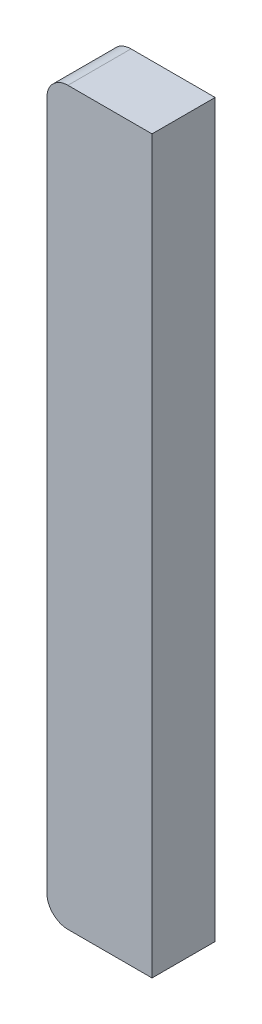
ISO-10303-21;
HEADER;
FILE_DESCRIPTION(('STEP AP214'),'2;1');
FILE_NAME('part.step','',(''),(''),'','','');
FILE_SCHEMA(('AUTOMOTIVE_DESIGN { 1 0 10303 214 1 1 1 1 }'));
ENDSEC;
DATA;
#1=APPLICATION_CONTEXT('core data for automotive mechanical design processes');
#2=APPLICATION_PROTOCOL_DEFINITION('international standard','automotive_design',2000,#1);
#3=PRODUCT_CONTEXT('',#1,'mechanical');
#4=PRODUCT('Part','Part','',(#3));
#5=PRODUCT_RELATED_PRODUCT_CATEGORY('part','',(#4));
#6=PRODUCT_DEFINITION_FORMATION('','',#4);
#7=PRODUCT_DEFINITION_CONTEXT('part definition',#1,'design');
#8=PRODUCT_DEFINITION('design','',#6,#7);
#9=PRODUCT_DEFINITION_SHAPE('','',#8);
#10=(LENGTH_UNIT() NAMED_UNIT(*) SI_UNIT(.MILLI.,.METRE.));
#11=(NAMED_UNIT(*) PLANE_ANGLE_UNIT() SI_UNIT($,.RADIAN.));
#12=(NAMED_UNIT(*) SI_UNIT($,.STERADIAN.) SOLID_ANGLE_UNIT());
#13=UNCERTAINTY_MEASURE_WITH_UNIT(LENGTH_MEASURE(1.E-05),#10,'distance_accuracy_value','');
#14=(GEOMETRIC_REPRESENTATION_CONTEXT(3) GLOBAL_UNCERTAINTY_ASSIGNED_CONTEXT((#13)) GLOBAL_UNIT_ASSIGNED_CONTEXT((#10,
#11,#12)) REPRESENTATION_CONTEXT('',''));
#15=CARTESIAN_POINT('',(0.,0.,0.));
#16=DIRECTION('',(0.,0.,1.));
#17=DIRECTION('',(1.,0.,0.));
#18=AXIS2_PLACEMENT_3D('',#15,#16,#17);
#19=CARTESIAN_POINT('',(-4.,-7.90989795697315,3.));
#20=DIRECTION('',(0.,-1.,0.));
#21=DIRECTION('',(0.,0.,-1.));
#22=AXIS2_PLACEMENT_3D('',#19,#20,#21);
#23=PLANE('',#22);
#24=DIRECTION('',(-1.,0.,0.));
#25=VECTOR('',#24,1.);
#26=CARTESIAN_POINT('',(-4.,-7.90989795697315,0.));
#27=LINE('',#26,#25);
#28=CARTESIAN_POINT('',(0.,-7.90989795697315,0.));
#29=VERTEX_POINT('',#28);
#30=CARTESIAN_POINT('',(-4.,-7.90989795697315,0.));
#31=VERTEX_POINT('',#30);
#32=EDGE_CURVE('E117',#29,#31,#27,.T.);
#33=ORIENTED_EDGE('',*,*,#32,.T.);
#34=DIRECTION('',(0.,0.,-1.));
#35=VECTOR('',#34,1.);
#36=CARTESIAN_POINT('',(-4.,-7.90989795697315,3.));
#37=LINE('',#36,#35);
#38=CARTESIAN_POINT('',(-4.,-7.90989795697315,3.));
#39=VERTEX_POINT('',#38);
#40=EDGE_CURVE('E11',#39,#31,#37,.T.);
#41=ORIENTED_EDGE('',*,*,#40,.F.);
#42=DIRECTION('',(-1.,0.,0.));
#43=VECTOR('',#42,1.);
#44=CARTESIAN_POINT('',(-4.,-7.90989795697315,3.));
#45=LINE('',#44,#43);
#46=CARTESIAN_POINT('',(0.,-7.90989795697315,3.));
#47=VERTEX_POINT('',#46);
#48=EDGE_CURVE('E127',#47,#39,#45,.T.);
#49=ORIENTED_EDGE('',*,*,#48,.F.);
#50=DIRECTION('',(0.,0.,-1.));
#51=VECTOR('',#50,1.);
#52=CARTESIAN_POINT('',(0.,-7.90989795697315,3.));
#53=LINE('',#52,#51);
#54=EDGE_CURVE('E113',#47,#29,#53,.T.);
#55=ORIENTED_EDGE('',*,*,#54,.T.);
#56=EDGE_LOOP('',(#33,#41,#49,#55));
#57=FACE_BOUND('',#56,.T.);
#58=ADVANCED_FACE('F33',(#57),#23,.F.);
#59=CARTESIAN_POINT('',(-4.,-8.90989795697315,3.));
#60=DIRECTION('',(0.,0.,-1.));
#61=DIRECTION('',(-1.,0.,0.));
#62=AXIS2_PLACEMENT_3D('',#59,#60,#61);
#63=CYLINDRICAL_SURFACE('',#62,1.);
#64=CARTESIAN_POINT('',(-4.,-8.90989795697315,0.));
#65=DIRECTION('',(0.,0.,1.));
#66=DIRECTION('',(-1.,0.,0.));
#67=AXIS2_PLACEMENT_3D('',#64,#65,#66);
#68=CIRCLE('',#67,1.);
#69=CARTESIAN_POINT('',(-5.,-8.90989795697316,0.));
#70=VERTEX_POINT('',#69);
#71=EDGE_CURVE('E120',#31,#70,#68,.T.);
#72=ORIENTED_EDGE('',*,*,#71,.T.);
#73=DIRECTION('',(0.,0.,-1.));
#74=VECTOR('',#73,1.);
#75=CARTESIAN_POINT('',(-5.,-8.90989795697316,3.));
#76=LINE('',#75,#74);
#77=CARTESIAN_POINT('',(-5.,-8.90989795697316,3.));
#78=VERTEX_POINT('',#77);
#79=EDGE_CURVE('E41',#78,#70,#76,.T.);
#80=ORIENTED_EDGE('',*,*,#79,.F.);
#81=CARTESIAN_POINT('',(-4.,-8.90989795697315,3.));
#82=DIRECTION('',(0.,0.,1.));
#83=DIRECTION('',(-1.,0.,0.));
#84=AXIS2_PLACEMENT_3D('',#81,#82,#83);
#85=CIRCLE('',#84,1.);
#86=EDGE_CURVE('E86',#39,#78,#85,.T.);
#87=ORIENTED_EDGE('',*,*,#86,.F.);
#88=ORIENTED_EDGE('',*,*,#40,.T.);
#89=EDGE_LOOP('',(#72,#80,#87,#88));
#90=FACE_BOUND('',#89,.T.);
#91=ADVANCED_FACE('F151',(#90),#63,.T.);
#92=CARTESIAN_POINT('',(-5.,-41.665103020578,3.));
#93=DIRECTION('',(1.,0.,0.));
#94=DIRECTION('',(0.,0.,-1.));
#95=AXIS2_PLACEMENT_3D('',#92,#93,#94);
#96=PLANE('',#95);
#97=DIRECTION('',(0.,-1.,0.));
#98=VECTOR('',#97,1.);
#99=CARTESIAN_POINT('',(-5.,-41.665103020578,0.));
#100=LINE('',#99,#98);
#101=CARTESIAN_POINT('',(-5.,-41.665103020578,0.));
#102=VERTEX_POINT('',#101);
#103=EDGE_CURVE('E122',#70,#102,#100,.T.);
#104=ORIENTED_EDGE('',*,*,#103,.T.);
#105=DIRECTION('',(0.,0.,-1.));
#106=VECTOR('',#105,1.);
#107=CARTESIAN_POINT('',(-5.,-41.665103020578,3.));
#108=LINE('',#107,#106);
#109=CARTESIAN_POINT('',(-5.,-41.665103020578,3.));
#110=VERTEX_POINT('',#109);
#111=EDGE_CURVE('E108',#110,#102,#108,.T.);
#112=ORIENTED_EDGE('',*,*,#111,.F.);
#113=DIRECTION('',(0.,-1.,0.));
#114=VECTOR('',#113,1.);
#115=CARTESIAN_POINT('',(-5.,-41.665103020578,3.));
#116=LINE('',#115,#114);
#117=EDGE_CURVE('E99',#78,#110,#116,.T.);
#118=ORIENTED_EDGE('',*,*,#117,.F.);
#119=ORIENTED_EDGE('',*,*,#79,.T.);
#120=EDGE_LOOP('',(#104,#112,#118,#119));
#121=FACE_BOUND('',#120,.T.);
#122=ADVANCED_FACE('F133',(#121),#96,.F.);
#123=CARTESIAN_POINT('',(-4.,-41.665103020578,3.));
#124=DIRECTION('',(0.,0.,-1.));
#125=DIRECTION('',(-1.,0.,0.));
#126=AXIS2_PLACEMENT_3D('',#123,#124,#125);
#127=CYLINDRICAL_SURFACE('',#126,1.);
#128=CARTESIAN_POINT('',(-4.,-41.665103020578,0.));
#129=DIRECTION('',(0.,0.,1.));
#130=DIRECTION('',(1.,0.,0.));
#131=AXIS2_PLACEMENT_3D('',#128,#129,#130);
#132=CIRCLE('',#131,1.);
#133=CARTESIAN_POINT('',(-4.,-42.665103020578,0.));
#134=VERTEX_POINT('',#133);
#135=EDGE_CURVE('E107',#102,#134,#132,.T.);
#136=ORIENTED_EDGE('',*,*,#135,.T.);
#137=DIRECTION('',(0.,0.,-1.));
#138=VECTOR('',#137,1.);
#139=CARTESIAN_POINT('',(-4.,-42.665103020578,3.));
#140=LINE('',#139,#138);
#141=CARTESIAN_POINT('',(-4.,-42.665103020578,3.));
#142=VERTEX_POINT('',#141);
#143=EDGE_CURVE('E104',#142,#134,#140,.T.);
#144=ORIENTED_EDGE('',*,*,#143,.F.);
#145=CARTESIAN_POINT('',(-4.,-41.665103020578,3.));
#146=DIRECTION('',(0.,0.,1.));
#147=DIRECTION('',(1.,0.,0.));
#148=AXIS2_PLACEMENT_3D('',#145,#146,#147);
#149=CIRCLE('',#148,1.);
#150=EDGE_CURVE('E93',#110,#142,#149,.T.);
#151=ORIENTED_EDGE('',*,*,#150,.F.);
#152=ORIENTED_EDGE('',*,*,#111,.T.);
#153=EDGE_LOOP('',(#136,#144,#151,#152));
#154=FACE_BOUND('',#153,.T.);
#155=ADVANCED_FACE('F105',(#154),#127,.T.);
#156=CARTESIAN_POINT('',(0.,-42.665103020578,3.));
#157=DIRECTION('',(0.,1.,0.));
#158=DIRECTION('',(0.,0.,1.));
#159=AXIS2_PLACEMENT_3D('',#156,#157,#158);
#160=PLANE('',#159);
#161=DIRECTION('',(1.,0.,0.));
#162=VECTOR('',#161,1.);
#163=CARTESIAN_POINT('',(0.,-42.665103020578,0.));
#164=LINE('',#163,#162);
#165=CARTESIAN_POINT('',(0.,-42.665103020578,0.));
#166=VERTEX_POINT('',#165);
#167=EDGE_CURVE('E72',#134,#166,#164,.T.);
#168=ORIENTED_EDGE('',*,*,#167,.T.);
#169=DIRECTION('',(0.,0.,-1.));
#170=VECTOR('',#169,1.);
#171=CARTESIAN_POINT('',(0.,-42.665103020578,3.));
#172=LINE('',#171,#170);
#173=CARTESIAN_POINT('',(0.,-42.665103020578,3.));
#174=VERTEX_POINT('',#173);
#175=EDGE_CURVE('E109',#174,#166,#172,.T.);
#176=ORIENTED_EDGE('',*,*,#175,.F.);
#177=DIRECTION('',(1.,0.,0.));
#178=VECTOR('',#177,1.);
#179=CARTESIAN_POINT('',(0.,-42.665103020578,3.));
#180=LINE('',#179,#178);
#181=EDGE_CURVE('E97',#142,#174,#180,.T.);
#182=ORIENTED_EDGE('',*,*,#181,.F.);
#183=ORIENTED_EDGE('',*,*,#143,.T.);
#184=EDGE_LOOP('',(#168,#176,#182,#183));
#185=FACE_BOUND('',#184,.T.);
#186=ADVANCED_FACE('F111',(#185),#160,.F.);
#187=CARTESIAN_POINT('',(0.,-7.90989795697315,3.));
#188=DIRECTION('',(-1.,0.,0.));
#189=DIRECTION('',(0.,-1.,0.));
#190=AXIS2_PLACEMENT_3D('',#187,#188,#189);
#191=PLANE('',#190);
#192=DIRECTION('',(0.,1.,0.));
#193=VECTOR('',#192,1.);
#194=CARTESIAN_POINT('',(0.,-7.90989795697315,0.));
#195=LINE('',#194,#193);
#196=EDGE_CURVE('E78',#166,#29,#195,.T.);
#197=ORIENTED_EDGE('',*,*,#196,.T.);
#198=ORIENTED_EDGE('',*,*,#54,.F.);
#199=DIRECTION('',(0.,1.,0.));
#200=VECTOR('',#199,1.);
#201=CARTESIAN_POINT('',(0.,-7.90989795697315,3.));
#202=LINE('',#201,#200);
#203=EDGE_CURVE('E49',#174,#47,#202,.T.);
#204=ORIENTED_EDGE('',*,*,#203,.F.);
#205=ORIENTED_EDGE('',*,*,#175,.T.);
#206=EDGE_LOOP('',(#197,#198,#204,#205));
#207=FACE_BOUND('',#206,.T.);
#208=ADVANCED_FACE('F140',(#207),#191,.F.);
#209=CARTESIAN_POINT('',(-4.,-41.665103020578,3.));
#210=DIRECTION('',(0.,0.,1.));
#211=DIRECTION('',(1.,0.,0.));
#212=AXIS2_PLACEMENT_3D('',#209,#210,#211);
#213=PLANE('',#212);
#214=ORIENTED_EDGE('',*,*,#48,.T.);
#215=ORIENTED_EDGE('',*,*,#86,.T.);
#216=ORIENTED_EDGE('',*,*,#117,.T.);
#217=ORIENTED_EDGE('',*,*,#150,.T.);
#218=ORIENTED_EDGE('',*,*,#181,.T.);
#219=ORIENTED_EDGE('',*,*,#203,.T.);
#220=EDGE_LOOP('',(#214,#215,#216,#217,#218,#219));
#221=FACE_BOUND('',#220,.T.);
#222=ADVANCED_FACE('F95',(#221),#213,.T.);
#223=CARTESIAN_POINT('',(-4.,-41.665103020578,0.));
#224=DIRECTION('',(0.,0.,1.));
#225=DIRECTION('',(1.,0.,0.));
#226=AXIS2_PLACEMENT_3D('',#223,#224,#225);
#227=PLANE('',#226);
#228=ORIENTED_EDGE('',*,*,#32,.F.);
#229=ORIENTED_EDGE('',*,*,#196,.F.);
#230=ORIENTED_EDGE('',*,*,#167,.F.);
#231=ORIENTED_EDGE('',*,*,#135,.F.);
#232=ORIENTED_EDGE('',*,*,#103,.F.);
#233=ORIENTED_EDGE('',*,*,#71,.F.);
#234=EDGE_LOOP('',(#228,#229,#230,#231,#232,#233));
#235=FACE_BOUND('',#234,.T.);
#236=ADVANCED_FACE('F136',(#235),#227,.F.);
#237=CLOSED_SHELL('',(#58,#91,#122,#155,#186,#208,#222,#236));
#238=MANIFOLD_SOLID_BREP('B2',#237);
#239=ADVANCED_BREP_SHAPE_REPRESENTATION('',(#18,#238),#14);
#240=SHAPE_DEFINITION_REPRESENTATION(#9,#239);
ENDSEC;
END-ISO-10303-21;
